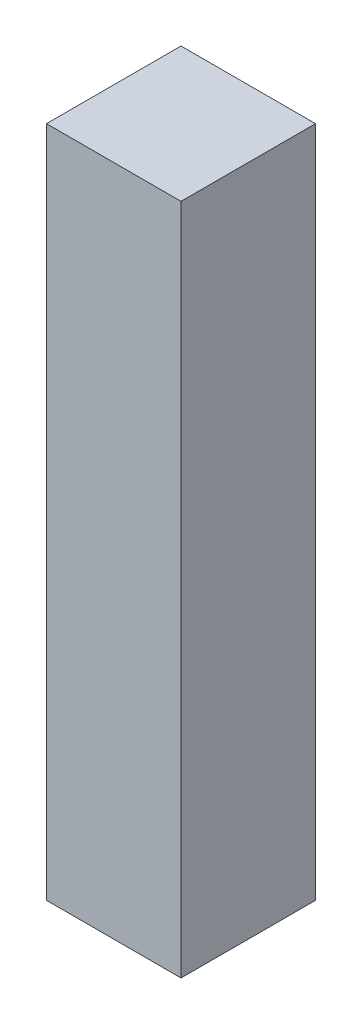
from build123d import *

# Parameters (mm, degrees)
ESQUISSE1_W            = 200
ESQUISSE1_H            = 200
FORME_EXT_RIEURE_DEPTH = 1000


with BuildPart() as part:
    # Esquisse1 → Forme ext_rieure (new body)
    with BuildSketch(Plane(origin=(0, 0, 0), x_dir=(1, 0, 0), z_dir=(0, 1, 0))):
        Rectangle(ESQUISSE1_W, ESQUISSE1_H)
    extrude(amount=FORME_EXT_RIEURE_DEPTH)


solid = part.part
